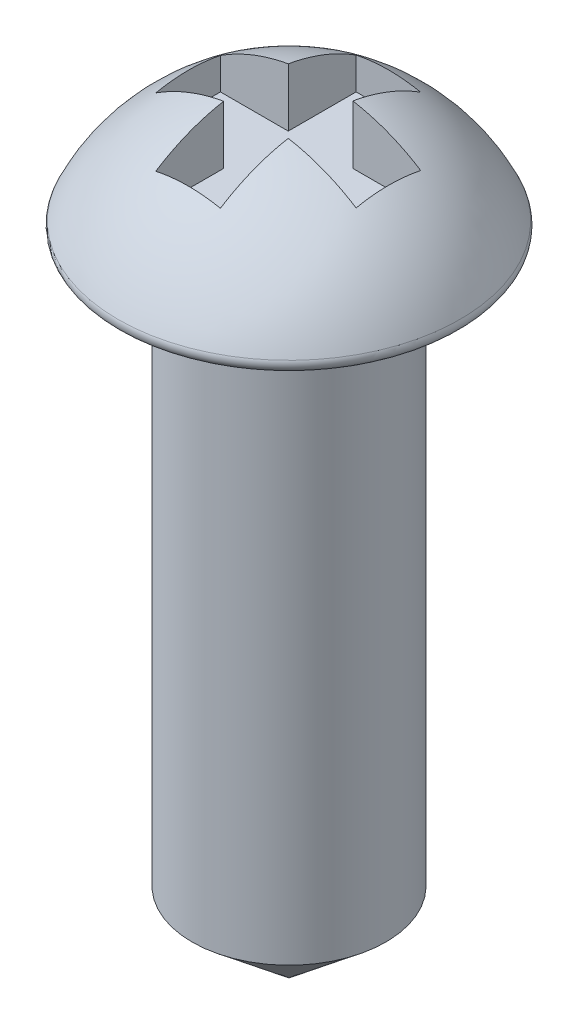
ISO-10303-21;
HEADER;
FILE_DESCRIPTION(('STEP AP214'),'2;1');
FILE_NAME('part.step','',(''),(''),'','','');
FILE_SCHEMA(('AUTOMOTIVE_DESIGN { 1 0 10303 214 1 1 1 1 }'));
ENDSEC;
DATA;
#1=APPLICATION_CONTEXT('core data for automotive mechanical design processes');
#2=APPLICATION_PROTOCOL_DEFINITION('international standard','automotive_design',2000,#1);
#3=PRODUCT_CONTEXT('',#1,'mechanical');
#4=PRODUCT('Part','Part','',(#3));
#5=PRODUCT_RELATED_PRODUCT_CATEGORY('part','',(#4));
#6=PRODUCT_DEFINITION_FORMATION('','',#4);
#7=PRODUCT_DEFINITION_CONTEXT('part definition',#1,'design');
#8=PRODUCT_DEFINITION('design','',#6,#7);
#9=PRODUCT_DEFINITION_SHAPE('','',#8);
#10=(LENGTH_UNIT() NAMED_UNIT(*) SI_UNIT(.MILLI.,.METRE.));
#11=(NAMED_UNIT(*) PLANE_ANGLE_UNIT() SI_UNIT($,.RADIAN.));
#12=(NAMED_UNIT(*) SI_UNIT($,.STERADIAN.) SOLID_ANGLE_UNIT());
#13=UNCERTAINTY_MEASURE_WITH_UNIT(LENGTH_MEASURE(1.E-05),#10,'distance_accuracy_value','');
#14=(GEOMETRIC_REPRESENTATION_CONTEXT(3) GLOBAL_UNCERTAINTY_ASSIGNED_CONTEXT((#13)) GLOBAL_UNIT_ASSIGNED_CONTEXT((#10,
#11,#12)) REPRESENTATION_CONTEXT('',''));
#15=CARTESIAN_POINT('',(0.,0.,0.));
#16=DIRECTION('',(0.,0.,1.));
#17=DIRECTION('',(1.,0.,0.));
#18=AXIS2_PLACEMENT_3D('',#15,#16,#17);
#19=CARTESIAN_POINT('',(0.,-0.755577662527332,0.));
#20=DIRECTION('',(0.,1.,0.));
#21=DIRECTION('',(1.,0.,0.));
#22=AXIS2_PLACEMENT_3D('',#19,#20,#21);
#23=SPHERICAL_SURFACE('',#22,2.13796576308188);
#24=CARTESIAN_POINT('',(0.,-0.755577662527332,0.370388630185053));
#25=DIRECTION('',(0.,0.,1.));
#26=DIRECTION('',(1.,0.,0.));
#27=AXIS2_PLACEMENT_3D('',#24,#25,#26);
#28=CIRCLE('',#27,2.10563763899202);
#29=CARTESIAN_POINT('',(1.13232028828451,1.01968587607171,0.370388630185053));
#30=VERTEX_POINT('',#29);
#31=CARTESIAN_POINT('',(0.361948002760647,1.31871824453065,0.370388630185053));
#32=VERTEX_POINT('',#31);
#33=EDGE_CURVE('E209',#30,#32,#28,.T.);
#34=ORIENTED_EDGE('',*,*,#33,.T.);
#35=CARTESIAN_POINT('',(0.361948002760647,-0.755577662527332,0.));
#36=DIRECTION('',(1.,0.,0.));
#37=DIRECTION('',(0.,0.,-1.));
#38=AXIS2_PLACEMENT_3D('',#35,#36,#37);
#39=CIRCLE('',#38,2.10710494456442);
#40=CARTESIAN_POINT('',(0.361948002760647,1.01601929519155,1.14076091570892));
#41=VERTEX_POINT('',#40);
#42=EDGE_CURVE('E11',#32,#41,#39,.T.);
#43=ORIENTED_EDGE('',*,*,#42,.T.);
#44=CARTESIAN_POINT('',(0.,-0.755577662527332,1.14076091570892));
#45=DIRECTION('',(0.,0.,1.));
#46=DIRECTION('',(1.,0.,0.));
#47=AXIS2_PLACEMENT_3D('',#44,#45,#46);
#48=CIRCLE('',#47,1.8081930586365);
#49=CARTESIAN_POINT('',(-0.371599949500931,1.01401992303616,1.14076091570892));
#50=VERTEX_POINT('',#49);
#51=EDGE_CURVE('E39',#41,#50,#48,.T.);
#52=ORIENTED_EDGE('',*,*,#51,.T.);
#53=CARTESIAN_POINT('',(-0.371599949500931,-0.755577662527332,0.));
#54=DIRECTION('',(-1.,0.,0.));
#55=DIRECTION('',(0.,0.,1.));
#56=AXIS2_PLACEMENT_3D('',#53,#54,#55);
#57=CIRCLE('',#56,2.10542420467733);
#58=CARTESIAN_POINT('',(-0.371599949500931,1.31701089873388,0.370388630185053));
#59=VERTEX_POINT('',#58);
#60=EDGE_CURVE('E235',#50,#59,#57,.T.);
#61=ORIENTED_EDGE('',*,*,#60,.T.);
#62=CARTESIAN_POINT('',(0.,-0.755577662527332,0.370388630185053));
#63=DIRECTION('',(0.,0.,1.));
#64=DIRECTION('',(1.,0.,0.));
#65=AXIS2_PLACEMENT_3D('',#62,#63,#64);
#66=CIRCLE('',#65,2.10563763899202);
#67=CARTESIAN_POINT('',(-1.14197223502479,1.01349251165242,0.370388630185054));
#68=VERTEX_POINT('',#67);
#69=EDGE_CURVE('E232',#59,#68,#66,.T.);
#70=ORIENTED_EDGE('',*,*,#69,.T.);
#71=CARTESIAN_POINT('',(-1.14197223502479,-0.755577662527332,0.));
#72=DIRECTION('',(-1.,0.,0.));
#73=DIRECTION('',(0.,0.,1.));
#74=AXIS2_PLACEMENT_3D('',#71,#72,#73);
#75=CIRCLE('',#74,1.80742828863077);
#76=CARTESIAN_POINT('',(-1.14197223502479,1.01499069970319,-0.363159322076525));
#77=VERTEX_POINT('',#76);
#78=EDGE_CURVE('E229',#68,#77,#75,.T.);
#79=ORIENTED_EDGE('',*,*,#78,.T.);
#80=CARTESIAN_POINT('',(0.,-0.755577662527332,-0.363159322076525));
#81=DIRECTION('',(0.,0.,-1.));
#82=DIRECTION('',(-1.,0.,0.));
#83=AXIS2_PLACEMENT_3D('',#80,#81,#82);
#84=CIRCLE('',#83,2.10689651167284);
#85=CARTESIAN_POINT('',(-0.371599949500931,1.31828983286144,-0.363159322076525));
#86=VERTEX_POINT('',#85);
#87=EDGE_CURVE('E226',#77,#86,#84,.T.);
#88=ORIENTED_EDGE('',*,*,#87,.T.);
#89=CARTESIAN_POINT('',(-0.371599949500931,-0.755577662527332,0.));
#90=DIRECTION('',(-1.,0.,0.));
#91=DIRECTION('',(0.,0.,1.));
#92=AXIS2_PLACEMENT_3D('',#89,#90,#91);
#93=CIRCLE('',#92,2.10542420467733);
#94=CARTESIAN_POINT('',(-0.371599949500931,1.01865940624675,-1.13353160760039));
#95=VERTEX_POINT('',#94);
#96=EDGE_CURVE('E223',#86,#95,#93,.T.);
#97=ORIENTED_EDGE('',*,*,#96,.T.);
#98=CARTESIAN_POINT('',(0.,-0.755577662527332,-1.13353160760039));
#99=DIRECTION('',(0.,0.,-1.));
#100=DIRECTION('',(-1.,0.,0.));
#101=AXIS2_PLACEMENT_3D('',#98,#99,#100);
#102=CIRCLE('',#101,1.81273376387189);
#103=CARTESIAN_POINT('',(0.361948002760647,1.0206535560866,-1.13353160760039));
#104=VERTEX_POINT('',#103);
#105=EDGE_CURVE('E220',#95,#104,#102,.T.);
#106=ORIENTED_EDGE('',*,*,#105,.T.);
#107=CARTESIAN_POINT('',(0.361948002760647,-0.755577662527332,0.));
#108=DIRECTION('',(1.,0.,0.));
#109=DIRECTION('',(0.,0.,-1.));
#110=AXIS2_PLACEMENT_3D('',#107,#108,#109);
#111=CIRCLE('',#110,2.10710494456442);
#112=CARTESIAN_POINT('',(0.361948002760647,1.31999612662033,-0.363159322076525));
#113=VERTEX_POINT('',#112);
#114=EDGE_CURVE('E217',#104,#113,#111,.T.);
#115=ORIENTED_EDGE('',*,*,#114,.T.);
#116=CARTESIAN_POINT('',(0.,-0.755577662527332,-0.363159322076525));
#117=DIRECTION('',(0.,0.,-1.));
#118=DIRECTION('',(-1.,0.,0.));
#119=AXIS2_PLACEMENT_3D('',#116,#117,#118);
#120=CIRCLE('',#119,2.10689651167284);
#121=CARTESIAN_POINT('',(1.13232028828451,1.02117884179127,-0.363159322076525));
#122=VERTEX_POINT('',#121);
#123=EDGE_CURVE('E214',#113,#122,#120,.T.);
#124=ORIENTED_EDGE('',*,*,#123,.T.);
#125=CARTESIAN_POINT('',(1.13232028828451,-0.755577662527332,0.));
#126=DIRECTION('',(1.,0.,0.));
#127=DIRECTION('',(0.,0.,-1.));
#128=AXIS2_PLACEMENT_3D('',#125,#126,#127);
#129=CIRCLE('',#128,1.81349065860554);
#130=EDGE_CURVE('E211',#122,#30,#129,.T.);
#131=ORIENTED_EDGE('',*,*,#130,.T.);
#132=EDGE_LOOP('',(#34,#43,#52,#61,#70,#79,#88,#97,#106,#115,#124,#131));
#133=FACE_BOUND('',#132,.T.);
#134=CARTESIAN_POINT('',(0.,0.141981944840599,0.));
#135=DIRECTION('',(0.,-1.,0.));
#136=DIRECTION('',(0.,0.,-1.));
#137=AXIS2_PLACEMENT_3D('',#134,#135,#136);
#138=CIRCLE('',#137,1.94043406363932);
#139=CARTESIAN_POINT('',(0.,0.141981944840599,-1.94043406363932));
#140=VERTEX_POINT('',#139);
#141=EDGE_CURVE('E203',#140,#140,#138,.F.);
#142=ORIENTED_EDGE('',*,*,#141,.T.);
#143=EDGE_LOOP('',(#142));
#144=FACE_BOUND('',#143,.T.);
#145=ADVANCED_FACE('F32',(#133,#144),#23,.T.);
#146=CARTESIAN_POINT('',(0.,-7.3028893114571,0.));
#147=DIRECTION('',(0.,1.,0.));
#148=DIRECTION('',(0.,0.,1.));
#149=AXIS2_PLACEMENT_3D('',#146,#147,#148);
#150=CONICAL_SURFACE('',#149,0.,0.883495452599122);
#151=CARTESIAN_POINT('',(0.,-6.4,0.));
#152=DIRECTION('',(0.,1.,0.));
#153=DIRECTION('',(0.,0.,1.));
#154=AXIS2_PLACEMENT_3D('',#151,#152,#153);
#155=CIRCLE('',#154,1.1);
#156=CARTESIAN_POINT('',(0.,-6.4,1.1));
#157=VERTEX_POINT('',#156);
#158=EDGE_CURVE('E200',#157,#157,#155,.T.);
#159=ORIENTED_EDGE('',*,*,#158,.F.);
#160=EDGE_LOOP('',(#159));
#161=FACE_BOUND('',#160,.T.);
#162=CARTESIAN_POINT('',(0.,-7.3028893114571,0.));
#163=VERTEX_POINT('',#162);
#164=VERTEX_LOOP('',#163);
#165=FACE_BOUND('',#164,.T.);
#166=ADVANCED_FACE('F277',(#161,#165),#150,.T.);
#167=CARTESIAN_POINT('',(0.,3.8000547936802,0.));
#168=DIRECTION('',(0.,1.,0.));
#169=DIRECTION('',(0.,0.,1.));
#170=AXIS2_PLACEMENT_3D('',#167,#168,#169);
#171=CYLINDRICAL_SURFACE('',#170,1.1);
#172=CARTESIAN_POINT('',(0.,0.,0.));
#173=DIRECTION('',(0.,1.,0.));
#174=DIRECTION('',(0.,0.,1.));
#175=AXIS2_PLACEMENT_3D('',#172,#173,#174);
#176=CIRCLE('',#175,1.1);
#177=CARTESIAN_POINT('',(0.,0.,1.1));
#178=VERTEX_POINT('',#177);
#179=EDGE_CURVE('E169',#178,#178,#176,.T.);
#180=ORIENTED_EDGE('',*,*,#179,.F.);
#181=EDGE_LOOP('',(#180));
#182=FACE_BOUND('',#181,.T.);
#183=ORIENTED_EDGE('',*,*,#158,.T.);
#184=EDGE_LOOP('',(#183));
#185=FACE_BOUND('',#184,.T.);
#186=ADVANCED_FACE('F281',(#182,#185),#171,.T.);
#187=CARTESIAN_POINT('',(2.,0.,0.));
#188=DIRECTION('',(0.,1.,0.));
#189=DIRECTION('',(0.,0.,1.));
#190=AXIS2_PLACEMENT_3D('',#187,#188,#189);
#191=PLANE('',#190);
#192=CARTESIAN_POINT('',(0.,0.,0.));
#193=DIRECTION('',(0.,1.,0.));
#194=DIRECTION('',(0.,0.,1.));
#195=AXIS2_PLACEMENT_3D('',#192,#193,#194);
#196=CIRCLE('',#195,1.84967329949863);
#197=CARTESIAN_POINT('',(0.,0.,1.84967329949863));
#198=VERTEX_POINT('',#197);
#199=EDGE_CURVE('E206',#198,#198,#196,.F.);
#200=ORIENTED_EDGE('',*,*,#199,.T.);
#201=EDGE_LOOP('',(#200));
#202=FACE_BOUND('',#201,.T.);
#203=ORIENTED_EDGE('',*,*,#179,.T.);
#204=EDGE_LOOP('',(#203));
#205=FACE_BOUND('',#204,.T.);
#206=ADVANCED_FACE('F286',(#202,#205),#191,.F.);
#207=CARTESIAN_POINT('',(0.,0.0999999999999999,0.));
#208=DIRECTION('',(0.,1.,0.));
#209=DIRECTION('',(0.,0.,1.));
#210=AXIS2_PLACEMENT_3D('',#207,#208,#209);
#211=TOROIDAL_SURFACE('',#210,1.84967329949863,0.1);
#212=ORIENTED_EDGE('',*,*,#199,.F.);
#213=EDGE_LOOP('',(#212));
#214=FACE_BOUND('',#213,.T.);
#215=ORIENTED_EDGE('',*,*,#141,.F.);
#216=EDGE_LOOP('',(#215));
#217=FACE_BOUND('',#216,.T.);
#218=ADVANCED_FACE('F293',(#214,#217),#211,.T.);
#219=CARTESIAN_POINT('',(0.361948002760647,0.656537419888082,1.14076091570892));
#220=DIRECTION('',(1.,0.,0.));
#221=DIRECTION('',(0.,0.,-1.));
#222=AXIS2_PLACEMENT_3D('',#219,#220,#221);
#223=PLANE('',#222);
#224=DIRECTION('',(0.,1.,0.));
#225=VECTOR('',#224,1.);
#226=CARTESIAN_POINT('',(0.361948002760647,0.656537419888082,0.370388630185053));
#227=LINE('',#226,#225);
#228=CARTESIAN_POINT('',(0.361948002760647,0.656537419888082,0.370388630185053));
#229=VERTEX_POINT('',#228);
#230=EDGE_CURVE('E46',#229,#32,#227,.T.);
#231=ORIENTED_EDGE('',*,*,#230,.F.);
#232=DIRECTION('',(0.,0.,-1.));
#233=VECTOR('',#232,1.);
#234=CARTESIAN_POINT('',(0.361948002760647,0.656537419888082,1.14076091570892));
#235=LINE('',#234,#233);
#236=CARTESIAN_POINT('',(0.361948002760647,0.656537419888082,1.14076091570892));
#237=VERTEX_POINT('',#236);
#238=EDGE_CURVE('E122',#237,#229,#235,.T.);
#239=ORIENTED_EDGE('',*,*,#238,.F.);
#240=DIRECTION('',(0.,1.,0.));
#241=VECTOR('',#240,1.);
#242=CARTESIAN_POINT('',(0.361948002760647,0.656537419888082,1.14076091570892));
#243=LINE('',#242,#241);
#244=EDGE_CURVE('E167',#237,#41,#243,.T.);
#245=ORIENTED_EDGE('',*,*,#244,.T.);
#246=ORIENTED_EDGE('',*,*,#42,.F.);
#247=EDGE_LOOP('',(#231,#239,#245,#246));
#248=FACE_BOUND('',#247,.T.);
#249=ADVANCED_FACE('F119',(#248),#223,.F.);
#250=CARTESIAN_POINT('',(0.361948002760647,0.656537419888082,1.14076091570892));
#251=DIRECTION('',(0.,0.,1.));
#252=DIRECTION('',(1.,0.,0.));
#253=AXIS2_PLACEMENT_3D('',#250,#251,#252);
#254=PLANE('',#253);
#255=ORIENTED_EDGE('',*,*,#244,.F.);
#256=DIRECTION('',(1.,0.,0.));
#257=VECTOR('',#256,1.);
#258=CARTESIAN_POINT('',(0.361948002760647,0.656537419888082,1.14076091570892));
#259=LINE('',#258,#257);
#260=CARTESIAN_POINT('',(-0.371599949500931,0.656537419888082,1.14076091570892));
#261=VERTEX_POINT('',#260);
#262=EDGE_CURVE('E126',#261,#237,#259,.T.);
#263=ORIENTED_EDGE('',*,*,#262,.F.);
#264=DIRECTION('',(0.,1.,0.));
#265=VECTOR('',#264,1.);
#266=CARTESIAN_POINT('',(-0.371599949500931,0.656537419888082,1.14076091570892));
#267=LINE('',#266,#265);
#268=EDGE_CURVE('E170',#261,#50,#267,.T.);
#269=ORIENTED_EDGE('',*,*,#268,.T.);
#270=ORIENTED_EDGE('',*,*,#51,.F.);
#271=EDGE_LOOP('',(#255,#263,#269,#270));
#272=FACE_BOUND('',#271,.T.);
#273=ADVANCED_FACE('F241',(#272),#254,.F.);
#274=CARTESIAN_POINT('',(-0.371599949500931,0.656537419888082,1.14076091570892));
#275=DIRECTION('',(-1.,0.,0.));
#276=DIRECTION('',(0.,0.,1.));
#277=AXIS2_PLACEMENT_3D('',#274,#275,#276);
#278=PLANE('',#277);
#279=ORIENTED_EDGE('',*,*,#268,.F.);
#280=DIRECTION('',(0.,0.,1.));
#281=VECTOR('',#280,1.);
#282=CARTESIAN_POINT('',(-0.371599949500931,0.656537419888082,1.14076091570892));
#283=LINE('',#282,#281);
#284=CARTESIAN_POINT('',(-0.371599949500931,0.656537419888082,0.370388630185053));
#285=VERTEX_POINT('',#284);
#286=EDGE_CURVE('E164',#285,#261,#283,.T.);
#287=ORIENTED_EDGE('',*,*,#286,.F.);
#288=DIRECTION('',(0.,1.,0.));
#289=VECTOR('',#288,1.);
#290=CARTESIAN_POINT('',(-0.371599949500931,0.656537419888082,0.370388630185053));
#291=LINE('',#290,#289);
#292=EDGE_CURVE('E173',#285,#59,#291,.T.);
#293=ORIENTED_EDGE('',*,*,#292,.T.);
#294=ORIENTED_EDGE('',*,*,#60,.F.);
#295=EDGE_LOOP('',(#279,#287,#293,#294));
#296=FACE_BOUND('',#295,.T.);
#297=ADVANCED_FACE('F244',(#296),#278,.F.);
#298=CARTESIAN_POINT('',(-0.371599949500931,0.656537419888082,0.370388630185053));
#299=DIRECTION('',(0.,0.,1.));
#300=DIRECTION('',(1.,0.,0.));
#301=AXIS2_PLACEMENT_3D('',#298,#299,#300);
#302=PLANE('',#301);
#303=ORIENTED_EDGE('',*,*,#292,.F.);
#304=DIRECTION('',(1.,0.,0.));
#305=VECTOR('',#304,1.);
#306=CARTESIAN_POINT('',(-0.371599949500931,0.656537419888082,0.370388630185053));
#307=LINE('',#306,#305);
#308=CARTESIAN_POINT('',(-1.14197223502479,0.656537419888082,0.370388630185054));
#309=VERTEX_POINT('',#308);
#310=EDGE_CURVE('E161',#309,#285,#307,.T.);
#311=ORIENTED_EDGE('',*,*,#310,.F.);
#312=DIRECTION('',(0.,1.,0.));
#313=VECTOR('',#312,1.);
#314=CARTESIAN_POINT('',(-1.14197223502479,0.656537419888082,0.370388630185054));
#315=LINE('',#314,#313);
#316=EDGE_CURVE('E176',#309,#68,#315,.T.);
#317=ORIENTED_EDGE('',*,*,#316,.T.);
#318=ORIENTED_EDGE('',*,*,#69,.F.);
#319=EDGE_LOOP('',(#303,#311,#317,#318));
#320=FACE_BOUND('',#319,.T.);
#321=ADVANCED_FACE('F248',(#320),#302,.F.);
#322=CARTESIAN_POINT('',(-1.14197223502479,0.656537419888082,0.370388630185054));
#323=DIRECTION('',(-1.,0.,0.));
#324=DIRECTION('',(0.,0.,1.));
#325=AXIS2_PLACEMENT_3D('',#322,#323,#324);
#326=PLANE('',#325);
#327=ORIENTED_EDGE('',*,*,#316,.F.);
#328=DIRECTION('',(0.,0.,1.));
#329=VECTOR('',#328,1.);
#330=CARTESIAN_POINT('',(-1.14197223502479,0.656537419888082,0.370388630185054));
#331=LINE('',#330,#329);
#332=CARTESIAN_POINT('',(-1.14197223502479,0.656537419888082,-0.363159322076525));
#333=VERTEX_POINT('',#332);
#334=EDGE_CURVE('E158',#333,#309,#331,.T.);
#335=ORIENTED_EDGE('',*,*,#334,.F.);
#336=DIRECTION('',(0.,1.,0.));
#337=VECTOR('',#336,1.);
#338=CARTESIAN_POINT('',(-1.14197223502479,0.656537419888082,-0.363159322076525));
#339=LINE('',#338,#337);
#340=EDGE_CURVE('E179',#333,#77,#339,.T.);
#341=ORIENTED_EDGE('',*,*,#340,.T.);
#342=ORIENTED_EDGE('',*,*,#78,.F.);
#343=EDGE_LOOP('',(#327,#335,#341,#342));
#344=FACE_BOUND('',#343,.T.);
#345=ADVANCED_FACE('F250',(#344),#326,.F.);
#346=CARTESIAN_POINT('',(-0.371599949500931,0.656537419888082,-0.363159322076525));
#347=DIRECTION('',(0.,0.,-1.));
#348=DIRECTION('',(-1.,0.,0.));
#349=AXIS2_PLACEMENT_3D('',#346,#347,#348);
#350=PLANE('',#349);
#351=ORIENTED_EDGE('',*,*,#340,.F.);
#352=DIRECTION('',(-1.,0.,0.));
#353=VECTOR('',#352,1.);
#354=CARTESIAN_POINT('',(-0.371599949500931,0.656537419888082,-0.363159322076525));
#355=LINE('',#354,#353);
#356=CARTESIAN_POINT('',(-0.371599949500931,0.656537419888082,-0.363159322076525));
#357=VERTEX_POINT('',#356);
#358=EDGE_CURVE('E155',#357,#333,#355,.T.);
#359=ORIENTED_EDGE('',*,*,#358,.F.);
#360=DIRECTION('',(0.,1.,0.));
#361=VECTOR('',#360,1.);
#362=CARTESIAN_POINT('',(-0.371599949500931,0.656537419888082,-0.363159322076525));
#363=LINE('',#362,#361);
#364=EDGE_CURVE('E182',#357,#86,#363,.T.);
#365=ORIENTED_EDGE('',*,*,#364,.T.);
#366=ORIENTED_EDGE('',*,*,#87,.F.);
#367=EDGE_LOOP('',(#351,#359,#365,#366));
#368=FACE_BOUND('',#367,.T.);
#369=ADVANCED_FACE('F253',(#368),#350,.F.);
#370=CARTESIAN_POINT('',(-0.371599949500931,0.656537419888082,-0.363159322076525));
#371=DIRECTION('',(-1.,0.,0.));
#372=DIRECTION('',(0.,0.,1.));
#373=AXIS2_PLACEMENT_3D('',#370,#371,#372);
#374=PLANE('',#373);
#375=ORIENTED_EDGE('',*,*,#364,.F.);
#376=DIRECTION('',(0.,0.,1.));
#377=VECTOR('',#376,1.);
#378=CARTESIAN_POINT('',(-0.371599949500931,0.656537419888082,-0.363159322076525));
#379=LINE('',#378,#377);
#380=CARTESIAN_POINT('',(-0.371599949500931,0.656537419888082,-1.13353160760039));
#381=VERTEX_POINT('',#380);
#382=EDGE_CURVE('E152',#381,#357,#379,.T.);
#383=ORIENTED_EDGE('',*,*,#382,.F.);
#384=DIRECTION('',(0.,1.,0.));
#385=VECTOR('',#384,1.);
#386=CARTESIAN_POINT('',(-0.371599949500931,0.656537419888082,-1.13353160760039));
#387=LINE('',#386,#385);
#388=EDGE_CURVE('E185',#381,#95,#387,.T.);
#389=ORIENTED_EDGE('',*,*,#388,.T.);
#390=ORIENTED_EDGE('',*,*,#96,.F.);
#391=EDGE_LOOP('',(#375,#383,#389,#390));
#392=FACE_BOUND('',#391,.T.);
#393=ADVANCED_FACE('F256',(#392),#374,.F.);
#394=CARTESIAN_POINT('',(0.361948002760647,0.656537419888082,-1.13353160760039));
#395=DIRECTION('',(0.,0.,-1.));
#396=DIRECTION('',(-1.,0.,0.));
#397=AXIS2_PLACEMENT_3D('',#394,#395,#396);
#398=PLANE('',#397);
#399=ORIENTED_EDGE('',*,*,#388,.F.);
#400=DIRECTION('',(-1.,0.,0.));
#401=VECTOR('',#400,1.);
#402=CARTESIAN_POINT('',(0.361948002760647,0.656537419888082,-1.13353160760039));
#403=LINE('',#402,#401);
#404=CARTESIAN_POINT('',(0.361948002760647,0.656537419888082,-1.13353160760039));
#405=VERTEX_POINT('',#404);
#406=EDGE_CURVE('E149',#405,#381,#403,.T.);
#407=ORIENTED_EDGE('',*,*,#406,.F.);
#408=DIRECTION('',(0.,1.,0.));
#409=VECTOR('',#408,1.);
#410=CARTESIAN_POINT('',(0.361948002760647,0.656537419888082,-1.13353160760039));
#411=LINE('',#410,#409);
#412=EDGE_CURVE('E188',#405,#104,#411,.T.);
#413=ORIENTED_EDGE('',*,*,#412,.T.);
#414=ORIENTED_EDGE('',*,*,#105,.F.);
#415=EDGE_LOOP('',(#399,#407,#413,#414));
#416=FACE_BOUND('',#415,.T.);
#417=ADVANCED_FACE('F258',(#416),#398,.F.);
#418=CARTESIAN_POINT('',(0.361948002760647,0.656537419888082,-0.363159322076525));
#419=DIRECTION('',(1.,0.,0.));
#420=DIRECTION('',(0.,0.,-1.));
#421=AXIS2_PLACEMENT_3D('',#418,#419,#420);
#422=PLANE('',#421);
#423=ORIENTED_EDGE('',*,*,#412,.F.);
#424=DIRECTION('',(0.,0.,-1.));
#425=VECTOR('',#424,1.);
#426=CARTESIAN_POINT('',(0.361948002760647,0.656537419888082,-0.363159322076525));
#427=LINE('',#426,#425);
#428=CARTESIAN_POINT('',(0.361948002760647,0.656537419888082,-0.363159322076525));
#429=VERTEX_POINT('',#428);
#430=EDGE_CURVE('E146',#429,#405,#427,.T.);
#431=ORIENTED_EDGE('',*,*,#430,.F.);
#432=DIRECTION('',(0.,1.,0.));
#433=VECTOR('',#432,1.);
#434=CARTESIAN_POINT('',(0.361948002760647,0.656537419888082,-0.363159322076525));
#435=LINE('',#434,#433);
#436=EDGE_CURVE('E191',#429,#113,#435,.T.);
#437=ORIENTED_EDGE('',*,*,#436,.T.);
#438=ORIENTED_EDGE('',*,*,#114,.F.);
#439=EDGE_LOOP('',(#423,#431,#437,#438));
#440=FACE_BOUND('',#439,.T.);
#441=ADVANCED_FACE('F262',(#440),#422,.F.);
#442=CARTESIAN_POINT('',(1.13232028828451,0.656537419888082,-0.363159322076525));
#443=DIRECTION('',(0.,0.,-1.));
#444=DIRECTION('',(-1.,0.,0.));
#445=AXIS2_PLACEMENT_3D('',#442,#443,#444);
#446=PLANE('',#445);
#447=ORIENTED_EDGE('',*,*,#436,.F.);
#448=DIRECTION('',(-1.,0.,0.));
#449=VECTOR('',#448,1.);
#450=CARTESIAN_POINT('',(1.13232028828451,0.656537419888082,-0.363159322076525));
#451=LINE('',#450,#449);
#452=CARTESIAN_POINT('',(1.13232028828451,0.656537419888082,-0.363159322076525));
#453=VERTEX_POINT('',#452);
#454=EDGE_CURVE('E143',#453,#429,#451,.T.);
#455=ORIENTED_EDGE('',*,*,#454,.F.);
#456=DIRECTION('',(0.,1.,0.));
#457=VECTOR('',#456,1.);
#458=CARTESIAN_POINT('',(1.13232028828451,0.656537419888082,-0.363159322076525));
#459=LINE('',#458,#457);
#460=EDGE_CURVE('E194',#453,#122,#459,.T.);
#461=ORIENTED_EDGE('',*,*,#460,.T.);
#462=ORIENTED_EDGE('',*,*,#123,.F.);
#463=EDGE_LOOP('',(#447,#455,#461,#462));
#464=FACE_BOUND('',#463,.T.);
#465=ADVANCED_FACE('F265',(#464),#446,.F.);
#466=CARTESIAN_POINT('',(1.13232028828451,0.656537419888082,0.370388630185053));
#467=DIRECTION('',(1.,0.,0.));
#468=DIRECTION('',(0.,0.,-1.));
#469=AXIS2_PLACEMENT_3D('',#466,#467,#468);
#470=PLANE('',#469);
#471=ORIENTED_EDGE('',*,*,#460,.F.);
#472=DIRECTION('',(0.,0.,-1.));
#473=VECTOR('',#472,1.);
#474=CARTESIAN_POINT('',(1.13232028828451,0.656537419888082,0.370388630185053));
#475=LINE('',#474,#473);
#476=CARTESIAN_POINT('',(1.13232028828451,0.656537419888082,0.370388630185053));
#477=VERTEX_POINT('',#476);
#478=EDGE_CURVE('E135',#477,#453,#475,.T.);
#479=ORIENTED_EDGE('',*,*,#478,.F.);
#480=DIRECTION('',(0.,1.,0.));
#481=VECTOR('',#480,1.);
#482=CARTESIAN_POINT('',(1.13232028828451,0.656537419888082,0.370388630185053));
#483=LINE('',#482,#481);
#484=EDGE_CURVE('E125',#477,#30,#483,.T.);
#485=ORIENTED_EDGE('',*,*,#484,.T.);
#486=ORIENTED_EDGE('',*,*,#130,.F.);
#487=EDGE_LOOP('',(#471,#479,#485,#486));
#488=FACE_BOUND('',#487,.T.);
#489=ADVANCED_FACE('F267',(#488),#470,.F.);
#490=CARTESIAN_POINT('',(1.13232028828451,0.656537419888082,0.370388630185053));
#491=DIRECTION('',(0.,0.,1.));
#492=DIRECTION('',(1.,0.,0.));
#493=AXIS2_PLACEMENT_3D('',#490,#491,#492);
#494=PLANE('',#493);
#495=ORIENTED_EDGE('',*,*,#484,.F.);
#496=DIRECTION('',(1.,0.,0.));
#497=VECTOR('',#496,1.);
#498=CARTESIAN_POINT('',(1.13232028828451,0.656537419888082,0.370388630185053));
#499=LINE('',#498,#497);
#500=EDGE_CURVE('E129',#229,#477,#499,.T.);
#501=ORIENTED_EDGE('',*,*,#500,.F.);
#502=ORIENTED_EDGE('',*,*,#230,.T.);
#503=ORIENTED_EDGE('',*,*,#33,.F.);
#504=EDGE_LOOP('',(#495,#501,#502,#503));
#505=FACE_BOUND('',#504,.T.);
#506=ADVANCED_FACE('F130',(#505),#494,.F.);
#507=CARTESIAN_POINT('',(0.361948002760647,0.656537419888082,-1.13353160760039));
#508=DIRECTION('',(0.,1.,0.));
#509=DIRECTION('',(0.,0.,1.));
#510=AXIS2_PLACEMENT_3D('',#507,#508,#509);
#511=PLANE('',#510);
#512=ORIENTED_EDGE('',*,*,#238,.T.);
#513=ORIENTED_EDGE('',*,*,#500,.T.);
#514=ORIENTED_EDGE('',*,*,#478,.T.);
#515=ORIENTED_EDGE('',*,*,#454,.T.);
#516=ORIENTED_EDGE('',*,*,#430,.T.);
#517=ORIENTED_EDGE('',*,*,#406,.T.);
#518=ORIENTED_EDGE('',*,*,#382,.T.);
#519=ORIENTED_EDGE('',*,*,#358,.T.);
#520=ORIENTED_EDGE('',*,*,#334,.T.);
#521=ORIENTED_EDGE('',*,*,#310,.T.);
#522=ORIENTED_EDGE('',*,*,#286,.T.);
#523=ORIENTED_EDGE('',*,*,#262,.T.);
#524=EDGE_LOOP('',(#512,#513,#514,#515,#516,#517,#518,#519,#520,#521,#522,#523));
#525=FACE_BOUND('',#524,.T.);
#526=ADVANCED_FACE('F137',(#525),#511,.T.);
#527=CLOSED_SHELL('',(#145,#166,#186,#206,#218,#249,#273,#297,#321,#345,#369,#393,#417,#441,
#465,#489,#506,#526));
#528=MANIFOLD_SOLID_BREP('B2',#527);
#529=ADVANCED_BREP_SHAPE_REPRESENTATION('',(#18,#528),#14);
#530=SHAPE_DEFINITION_REPRESENTATION(#9,#529);
ENDSEC;
END-ISO-10303-21;
